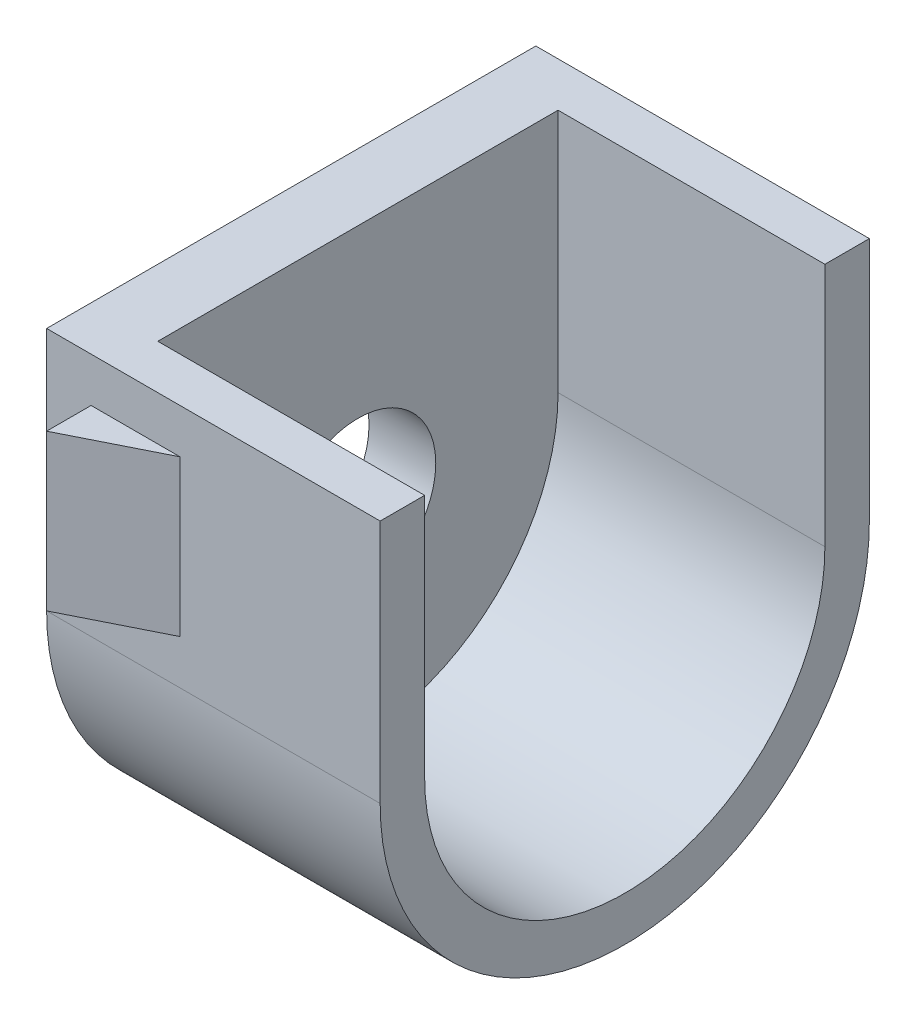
ISO-10303-21;
HEADER;
FILE_DESCRIPTION(('STEP AP214'),'2;1');
FILE_NAME('part.step','',(''),(''),'','','');
FILE_SCHEMA(('AUTOMOTIVE_DESIGN { 1 0 10303 214 1 1 1 1 }'));
ENDSEC;
DATA;
#1=APPLICATION_CONTEXT('core data for automotive mechanical design processes');
#2=APPLICATION_PROTOCOL_DEFINITION('international standard','automotive_design',2000,#1);
#3=PRODUCT_CONTEXT('',#1,'mechanical');
#4=PRODUCT('Part','Part','',(#3));
#5=PRODUCT_RELATED_PRODUCT_CATEGORY('part','',(#4));
#6=PRODUCT_DEFINITION_FORMATION('','',#4);
#7=PRODUCT_DEFINITION_CONTEXT('part definition',#1,'design');
#8=PRODUCT_DEFINITION('design','',#6,#7);
#9=PRODUCT_DEFINITION_SHAPE('','',#8);
#10=(LENGTH_UNIT() NAMED_UNIT(*) SI_UNIT(.MILLI.,.METRE.));
#11=(NAMED_UNIT(*) PLANE_ANGLE_UNIT() SI_UNIT($,.RADIAN.));
#12=(NAMED_UNIT(*) SI_UNIT($,.STERADIAN.) SOLID_ANGLE_UNIT());
#13=UNCERTAINTY_MEASURE_WITH_UNIT(LENGTH_MEASURE(1.E-05),#10,'distance_accuracy_value','');
#14=(GEOMETRIC_REPRESENTATION_CONTEXT(3) GLOBAL_UNCERTAINTY_ASSIGNED_CONTEXT((#13)) GLOBAL_UNIT_ASSIGNED_CONTEXT((#10,
#11,#12)) REPRESENTATION_CONTEXT('',''));
#15=CARTESIAN_POINT('',(0.,0.,0.));
#16=DIRECTION('',(0.,0.,1.));
#17=DIRECTION('',(1.,0.,0.));
#18=AXIS2_PLACEMENT_3D('',#15,#16,#17);
#19=CARTESIAN_POINT('',(15.,0.,11.));
#20=DIRECTION('',(0.,0.,-1.));
#21=DIRECTION('',(-1.,0.,0.));
#22=AXIS2_PLACEMENT_3D('',#19,#20,#21);
#23=PLANE('',#22);
#24=DIRECTION('',(-1.,0.,0.));
#25=VECTOR('',#24,1.);
#26=CARTESIAN_POINT('',(15.,11.,11.));
#27=LINE('',#26,#25);
#28=CARTESIAN_POINT('',(15.,11.,11.));
#29=VERTEX_POINT('',#28);
#30=CARTESIAN_POINT('',(0.,11.,11.));
#31=VERTEX_POINT('',#30);
#32=EDGE_CURVE('E285',#29,#31,#27,.T.);
#33=ORIENTED_EDGE('',*,*,#32,.T.);
#34=DIRECTION('',(0.,-1.,0.));
#35=VECTOR('',#34,1.);
#36=CARTESIAN_POINT('',(0.,0.,11.));
#37=LINE('',#36,#35);
#38=CARTESIAN_POINT('',(0.,0.,11.));
#39=VERTEX_POINT('',#38);
#40=EDGE_CURVE('E258',#31,#39,#37,.T.);
#41=ORIENTED_EDGE('',*,*,#40,.T.);
#42=DIRECTION('',(-1.,0.,0.));
#43=VECTOR('',#42,1.);
#44=CARTESIAN_POINT('',(15.,0.,11.));
#45=LINE('',#44,#43);
#46=CARTESIAN_POINT('',(15.,0.,11.));
#47=VERTEX_POINT('',#46);
#48=EDGE_CURVE('E269',#47,#39,#45,.T.);
#49=ORIENTED_EDGE('',*,*,#48,.F.);
#50=DIRECTION('',(0.,-1.,0.));
#51=VECTOR('',#50,1.);
#52=CARTESIAN_POINT('',(15.,0.,11.));
#53=LINE('',#52,#51);
#54=EDGE_CURVE('E266',#29,#47,#53,.T.);
#55=ORIENTED_EDGE('',*,*,#54,.F.);
#56=EDGE_LOOP('',(#33,#41,#49,#55));
#57=FACE_BOUND('',#56,.T.);
#58=DIRECTION('',(0.,-1.,0.));
#59=VECTOR('',#58,1.);
#60=CARTESIAN_POINT('',(2.,9.,11.));
#61=LINE('',#60,#59);
#62=CARTESIAN_POINT('',(2.,9.,11.));
#63=VERTEX_POINT('',#62);
#64=CARTESIAN_POINT('',(2.,2.,11.));
#65=VERTEX_POINT('',#64);
#66=EDGE_CURVE('E166',#63,#65,#61,.T.);
#67=ORIENTED_EDGE('',*,*,#66,.F.);
#68=DIRECTION('',(-1.,0.,0.));
#69=VECTOR('',#68,1.);
#70=CARTESIAN_POINT('',(2.,9.,11.));
#71=LINE('',#70,#69);
#72=CARTESIAN_POINT('',(6.,9.,11.));
#73=VERTEX_POINT('',#72);
#74=EDGE_CURVE('E157',#73,#63,#71,.T.);
#75=ORIENTED_EDGE('',*,*,#74,.F.);
#76=DIRECTION('',(0.,1.,0.));
#77=VECTOR('',#76,1.);
#78=CARTESIAN_POINT('',(6.,9.,11.));
#79=LINE('',#78,#77);
#80=CARTESIAN_POINT('',(6.,2.,11.));
#81=VERTEX_POINT('',#80);
#82=EDGE_CURVE('E534',#81,#73,#79,.T.);
#83=ORIENTED_EDGE('',*,*,#82,.F.);
#84=DIRECTION('',(1.,0.,0.));
#85=VECTOR('',#84,1.);
#86=CARTESIAN_POINT('',(2.,2.,11.));
#87=LINE('',#86,#85);
#88=EDGE_CURVE('E59',#65,#81,#87,.T.);
#89=ORIENTED_EDGE('',*,*,#88,.F.);
#90=EDGE_LOOP('',(#67,#75,#83,#89));
#91=FACE_BOUND('',#90,.T.);
#92=ADVANCED_FACE('F43',(#57,#91),#23,.F.);
#93=CARTESIAN_POINT('',(15.,0.,-11.));
#94=DIRECTION('',(0.,0.,1.));
#95=DIRECTION('',(1.,0.,0.));
#96=AXIS2_PLACEMENT_3D('',#93,#94,#95);
#97=PLANE('',#96);
#98=DIRECTION('',(-1.,0.,0.));
#99=VECTOR('',#98,1.);
#100=CARTESIAN_POINT('',(15.,0.,-11.));
#101=LINE('',#100,#99);
#102=CARTESIAN_POINT('',(15.,0.,-11.));
#103=VERTEX_POINT('',#102);
#104=CARTESIAN_POINT('',(0.,0.,-11.));
#105=VERTEX_POINT('',#104);
#106=EDGE_CURVE('E11',#103,#105,#101,.T.);
#107=ORIENTED_EDGE('',*,*,#106,.T.);
#108=DIRECTION('',(0.,1.,0.));
#109=VECTOR('',#108,1.);
#110=CARTESIAN_POINT('',(0.,0.,-11.));
#111=LINE('',#110,#109);
#112=CARTESIAN_POINT('',(0.,11.,-11.));
#113=VERTEX_POINT('',#112);
#114=EDGE_CURVE('E273',#105,#113,#111,.T.);
#115=ORIENTED_EDGE('',*,*,#114,.T.);
#116=DIRECTION('',(-1.,0.,0.));
#117=VECTOR('',#116,1.);
#118=CARTESIAN_POINT('',(15.,11.,-11.));
#119=LINE('',#118,#117);
#120=CARTESIAN_POINT('',(15.,11.,-11.));
#121=VERTEX_POINT('',#120);
#122=EDGE_CURVE('E52',#121,#113,#119,.T.);
#123=ORIENTED_EDGE('',*,*,#122,.F.);
#124=DIRECTION('',(0.,1.,0.));
#125=VECTOR('',#124,1.);
#126=CARTESIAN_POINT('',(15.,0.,-11.));
#127=LINE('',#126,#125);
#128=EDGE_CURVE('E257',#103,#121,#127,.T.);
#129=ORIENTED_EDGE('',*,*,#128,.F.);
#130=EDGE_LOOP('',(#107,#115,#123,#129));
#131=FACE_BOUND('',#130,.T.);
#132=DIRECTION('',(0.,-1.,0.));
#133=VECTOR('',#132,1.);
#134=CARTESIAN_POINT('',(6.,9.,-11.));
#135=LINE('',#134,#133);
#136=CARTESIAN_POINT('',(6.,9.,-11.));
#137=VERTEX_POINT('',#136);
#138=CARTESIAN_POINT('',(6.,2.,-11.));
#139=VERTEX_POINT('',#138);
#140=EDGE_CURVE('E180',#137,#139,#135,.T.);
#141=ORIENTED_EDGE('',*,*,#140,.F.);
#142=DIRECTION('',(1.,0.,0.));
#143=VECTOR('',#142,1.);
#144=CARTESIAN_POINT('',(6.,9.,-11.));
#145=LINE('',#144,#143);
#146=CARTESIAN_POINT('',(2.,9.,-11.));
#147=VERTEX_POINT('',#146);
#148=EDGE_CURVE('E185',#147,#137,#145,.T.);
#149=ORIENTED_EDGE('',*,*,#148,.F.);
#150=DIRECTION('',(0.,1.,0.));
#151=VECTOR('',#150,1.);
#152=CARTESIAN_POINT('',(2.,9.,-11.));
#153=LINE('',#152,#151);
#154=CARTESIAN_POINT('',(2.,2.,-11.));
#155=VERTEX_POINT('',#154);
#156=EDGE_CURVE('E67',#155,#147,#153,.T.);
#157=ORIENTED_EDGE('',*,*,#156,.F.);
#158=DIRECTION('',(-1.,0.,0.));
#159=VECTOR('',#158,1.);
#160=CARTESIAN_POINT('',(6.,2.,-11.));
#161=LINE('',#160,#159);
#162=EDGE_CURVE('E188',#139,#155,#161,.T.);
#163=ORIENTED_EDGE('',*,*,#162,.F.);
#164=EDGE_LOOP('',(#141,#149,#157,#163));
#165=FACE_BOUND('',#164,.T.);
#166=ADVANCED_FACE('F334',(#131,#165),#97,.F.);
#167=CARTESIAN_POINT('',(15.,11.,11.));
#168=DIRECTION('',(0.,-1.,0.));
#169=DIRECTION('',(0.,0.,-1.));
#170=AXIS2_PLACEMENT_3D('',#167,#168,#169);
#171=PLANE('',#170);
#172=DIRECTION('',(1.,0.,0.));
#173=VECTOR('',#172,1.);
#174=CARTESIAN_POINT('',(3.,11.,9.));
#175=LINE('',#174,#173);
#176=CARTESIAN_POINT('',(3.,11.,9.));
#177=VERTEX_POINT('',#176);
#178=CARTESIAN_POINT('',(15.,11.,9.));
#179=VERTEX_POINT('',#178);
#180=EDGE_CURVE('E249',#177,#179,#175,.T.);
#181=ORIENTED_EDGE('',*,*,#180,.F.);
#182=DIRECTION('',(0.,0.,-1.));
#183=VECTOR('',#182,1.);
#184=CARTESIAN_POINT('',(3.,11.,9.));
#185=LINE('',#184,#183);
#186=CARTESIAN_POINT('',(3.,11.,-9.));
#187=VERTEX_POINT('',#186);
#188=EDGE_CURVE('E216',#177,#187,#185,.T.);
#189=ORIENTED_EDGE('',*,*,#188,.T.);
#190=DIRECTION('',(1.,0.,0.));
#191=VECTOR('',#190,1.);
#192=CARTESIAN_POINT('',(3.,11.,-9.));
#193=LINE('',#192,#191);
#194=CARTESIAN_POINT('',(15.,11.,-9.));
#195=VERTEX_POINT('',#194);
#196=EDGE_CURVE('E245',#187,#195,#193,.T.);
#197=ORIENTED_EDGE('',*,*,#196,.T.);
#198=DIRECTION('',(0.,0.,1.));
#199=VECTOR('',#198,1.);
#200=CARTESIAN_POINT('',(15.,11.,11.));
#201=LINE('',#200,#199);
#202=EDGE_CURVE('E262',#121,#195,#201,.T.);
#203=ORIENTED_EDGE('',*,*,#202,.F.);
#204=ORIENTED_EDGE('',*,*,#122,.T.);
#205=DIRECTION('',(0.,0.,1.));
#206=VECTOR('',#205,1.);
#207=CARTESIAN_POINT('',(0.,11.,11.));
#208=LINE('',#207,#206);
#209=EDGE_CURVE('E276',#113,#31,#208,.T.);
#210=ORIENTED_EDGE('',*,*,#209,.T.);
#211=ORIENTED_EDGE('',*,*,#32,.F.);
#212=EDGE_CURVE('E261',#179,#29,#201,.T.);
#213=ORIENTED_EDGE('',*,*,#212,.F.);
#214=EDGE_LOOP('',(#181,#189,#197,#203,#204,#210,#211,#213));
#215=FACE_BOUND('',#214,.T.);
#216=ADVANCED_FACE('F294',(#215),#171,.F.);
#217=CARTESIAN_POINT('',(15.,0.,0.));
#218=DIRECTION('',(1.,0.,0.));
#219=DIRECTION('',(0.,0.,-1.));
#220=AXIS2_PLACEMENT_3D('',#217,#218,#219);
#221=PLANE('',#220);
#222=CARTESIAN_POINT('',(15.,0.,0.));
#223=DIRECTION('',(1.,0.,0.));
#224=DIRECTION('',(0.,0.,-1.));
#225=AXIS2_PLACEMENT_3D('',#222,#223,#224);
#226=CIRCLE('',#225,9.);
#227=CARTESIAN_POINT('',(15.,0.,9.));
#228=VERTEX_POINT('',#227);
#229=CARTESIAN_POINT('',(15.,0.,-9.));
#230=VERTEX_POINT('',#229);
#231=EDGE_CURVE('E217',#228,#230,#226,.T.);
#232=ORIENTED_EDGE('',*,*,#231,.F.);
#233=DIRECTION('',(0.,1.,0.));
#234=VECTOR('',#233,1.);
#235=CARTESIAN_POINT('',(15.,0.,9.));
#236=LINE('',#235,#234);
#237=EDGE_CURVE('E208',#228,#179,#236,.T.);
#238=ORIENTED_EDGE('',*,*,#237,.T.);
#239=ORIENTED_EDGE('',*,*,#212,.T.);
#240=ORIENTED_EDGE('',*,*,#54,.T.);
#241=CARTESIAN_POINT('',(15.,0.,0.));
#242=DIRECTION('',(1.,0.,0.));
#243=DIRECTION('',(0.,0.,-1.));
#244=AXIS2_PLACEMENT_3D('',#241,#242,#243);
#245=CIRCLE('',#244,11.);
#246=EDGE_CURVE('E253',#47,#103,#245,.T.);
#247=ORIENTED_EDGE('',*,*,#246,.T.);
#248=ORIENTED_EDGE('',*,*,#128,.T.);
#249=ORIENTED_EDGE('',*,*,#202,.T.);
#250=DIRECTION('',(0.,1.,0.));
#251=VECTOR('',#250,1.);
#252=CARTESIAN_POINT('',(15.,0.,-9.));
#253=LINE('',#252,#251);
#254=EDGE_CURVE('E233',#230,#195,#253,.T.);
#255=ORIENTED_EDGE('',*,*,#254,.F.);
#256=EDGE_LOOP('',(#232,#238,#239,#240,#247,#248,#249,#255));
#257=FACE_BOUND('',#256,.T.);
#258=ADVANCED_FACE('F310',(#257),#221,.T.);
#259=CARTESIAN_POINT('',(15.,0.,0.));
#260=DIRECTION('',(-1.,0.,0.));
#261=DIRECTION('',(0.,0.,1.));
#262=AXIS2_PLACEMENT_3D('',#259,#260,#261);
#263=CYLINDRICAL_SURFACE('',#262,11.);
#264=CARTESIAN_POINT('',(0.,0.,0.));
#265=DIRECTION('',(1.,0.,0.));
#266=DIRECTION('',(0.,0.,-1.));
#267=AXIS2_PLACEMENT_3D('',#264,#265,#266);
#268=CIRCLE('',#267,11.);
#269=EDGE_CURVE('E252',#39,#105,#268,.T.);
#270=ORIENTED_EDGE('',*,*,#269,.T.);
#271=ORIENTED_EDGE('',*,*,#106,.F.);
#272=ORIENTED_EDGE('',*,*,#246,.F.);
#273=ORIENTED_EDGE('',*,*,#48,.T.);
#274=EDGE_LOOP('',(#270,#271,#272,#273));
#275=FACE_BOUND('',#274,.T.);
#276=ADVANCED_FACE('F45',(#275),#263,.T.);
#277=CARTESIAN_POINT('',(0.,0.,0.));
#278=DIRECTION('',(1.,0.,0.));
#279=DIRECTION('',(0.,0.,-1.));
#280=AXIS2_PLACEMENT_3D('',#277,#278,#279);
#281=PLANE('',#280);
#282=CARTESIAN_POINT('',(0.,0.,0.));
#283=DIRECTION('',(1.,0.,0.));
#284=DIRECTION('',(0.,0.,-1.));
#285=AXIS2_PLACEMENT_3D('',#282,#283,#284);
#286=CIRCLE('',#285,3.5);
#287=CARTESIAN_POINT('',(0.,0.,-3.5));
#288=VERTEX_POINT('',#287);
#289=EDGE_CURVE('E204',#288,#288,#286,.T.);
#290=ORIENTED_EDGE('',*,*,#289,.T.);
#291=EDGE_LOOP('',(#290));
#292=FACE_BOUND('',#291,.T.);
#293=ORIENTED_EDGE('',*,*,#269,.F.);
#294=ORIENTED_EDGE('',*,*,#40,.F.);
#295=ORIENTED_EDGE('',*,*,#209,.F.);
#296=ORIENTED_EDGE('',*,*,#114,.F.);
#297=EDGE_LOOP('',(#293,#294,#295,#296));
#298=FACE_BOUND('',#297,.T.);
#299=ADVANCED_FACE('F301',(#292,#298),#281,.F.);
#300=CARTESIAN_POINT('',(3.,0.,9.));
#301=DIRECTION('',(0.,0.,-1.));
#302=DIRECTION('',(-1.,0.,0.));
#303=AXIS2_PLACEMENT_3D('',#300,#301,#302);
#304=PLANE('',#303);
#305=ORIENTED_EDGE('',*,*,#237,.F.);
#306=DIRECTION('',(1.,0.,0.));
#307=VECTOR('',#306,1.);
#308=CARTESIAN_POINT('',(3.,0.,9.));
#309=LINE('',#308,#307);
#310=CARTESIAN_POINT('',(3.,0.,9.));
#311=VERTEX_POINT('',#310);
#312=EDGE_CURVE('E229',#311,#228,#309,.T.);
#313=ORIENTED_EDGE('',*,*,#312,.F.);
#314=DIRECTION('',(0.,1.,0.));
#315=VECTOR('',#314,1.);
#316=CARTESIAN_POINT('',(3.,0.,9.));
#317=LINE('',#316,#315);
#318=EDGE_CURVE('E212',#311,#177,#317,.T.);
#319=ORIENTED_EDGE('',*,*,#318,.T.);
#320=ORIENTED_EDGE('',*,*,#180,.T.);
#321=EDGE_LOOP('',(#305,#313,#319,#320));
#322=FACE_BOUND('',#321,.T.);
#323=ADVANCED_FACE('F314',(#322),#304,.T.);
#324=CARTESIAN_POINT('',(3.,0.,-9.));
#325=DIRECTION('',(0.,0.,-1.));
#326=DIRECTION('',(-1.,0.,0.));
#327=AXIS2_PLACEMENT_3D('',#324,#325,#326);
#328=PLANE('',#327);
#329=ORIENTED_EDGE('',*,*,#254,.T.);
#330=ORIENTED_EDGE('',*,*,#196,.F.);
#331=DIRECTION('',(0.,1.,0.));
#332=VECTOR('',#331,1.);
#333=CARTESIAN_POINT('',(3.,0.,-9.));
#334=LINE('',#333,#332);
#335=CARTESIAN_POINT('',(3.,0.,-9.));
#336=VERTEX_POINT('',#335);
#337=EDGE_CURVE('E221',#336,#187,#334,.T.);
#338=ORIENTED_EDGE('',*,*,#337,.F.);
#339=DIRECTION('',(1.,0.,0.));
#340=VECTOR('',#339,1.);
#341=CARTESIAN_POINT('',(3.,0.,-9.));
#342=LINE('',#341,#340);
#343=EDGE_CURVE('E242',#336,#230,#342,.T.);
#344=ORIENTED_EDGE('',*,*,#343,.T.);
#345=EDGE_LOOP('',(#329,#330,#338,#344));
#346=FACE_BOUND('',#345,.T.);
#347=ADVANCED_FACE('F324',(#346),#328,.F.);
#348=CARTESIAN_POINT('',(3.,0.,0.));
#349=DIRECTION('',(1.,0.,0.));
#350=DIRECTION('',(0.,0.,-1.));
#351=AXIS2_PLACEMENT_3D('',#348,#349,#350);
#352=CYLINDRICAL_SURFACE('',#351,9.);
#353=ORIENTED_EDGE('',*,*,#231,.T.);
#354=ORIENTED_EDGE('',*,*,#343,.F.);
#355=CARTESIAN_POINT('',(3.,0.,0.));
#356=DIRECTION('',(1.,0.,0.));
#357=DIRECTION('',(0.,0.,-1.));
#358=AXIS2_PLACEMENT_3D('',#355,#356,#357);
#359=CIRCLE('',#358,9.);
#360=EDGE_CURVE('E225',#311,#336,#359,.T.);
#361=ORIENTED_EDGE('',*,*,#360,.F.);
#362=ORIENTED_EDGE('',*,*,#312,.T.);
#363=EDGE_LOOP('',(#353,#354,#361,#362));
#364=FACE_BOUND('',#363,.T.);
#365=ADVANCED_FACE('F320',(#364),#352,.F.);
#366=CARTESIAN_POINT('',(3.,0.,0.));
#367=DIRECTION('',(1.,0.,0.));
#368=DIRECTION('',(0.,0.,-1.));
#369=AXIS2_PLACEMENT_3D('',#366,#367,#368);
#370=PLANE('',#369);
#371=CARTESIAN_POINT('',(3.,0.,0.));
#372=DIRECTION('',(1.,0.,0.));
#373=DIRECTION('',(0.,0.,-1.));
#374=AXIS2_PLACEMENT_3D('',#371,#372,#373);
#375=CIRCLE('',#374,3.5);
#376=CARTESIAN_POINT('',(3.,0.,-3.5));
#377=VERTEX_POINT('',#376);
#378=EDGE_CURVE('E203',#377,#377,#375,.T.);
#379=ORIENTED_EDGE('',*,*,#378,.F.);
#380=EDGE_LOOP('',(#379));
#381=FACE_BOUND('',#380,.T.);
#382=ORIENTED_EDGE('',*,*,#318,.F.);
#383=ORIENTED_EDGE('',*,*,#360,.T.);
#384=ORIENTED_EDGE('',*,*,#337,.T.);
#385=ORIENTED_EDGE('',*,*,#188,.F.);
#386=EDGE_LOOP('',(#382,#383,#384,#385));
#387=FACE_BOUND('',#386,.T.);
#388=ADVANCED_FACE('F318',(#381,#387),#370,.T.);
#389=CARTESIAN_POINT('',(0.,0.,0.));
#390=DIRECTION('',(1.,0.,0.));
#391=DIRECTION('',(0.,0.,-1.));
#392=AXIS2_PLACEMENT_3D('',#389,#390,#391);
#393=CYLINDRICAL_SURFACE('',#392,3.5);
#394=ORIENTED_EDGE('',*,*,#289,.F.);
#395=EDGE_LOOP('',(#394));
#396=FACE_BOUND('',#395,.T.);
#397=ORIENTED_EDGE('',*,*,#378,.T.);
#398=EDGE_LOOP('',(#397));
#399=FACE_BOUND('',#398,.T.);
#400=ADVANCED_FACE('F357',(#396,#399),#393,.F.);
#401=CARTESIAN_POINT('',(6.,2.,-13.));
#402=DIRECTION('',(0.,1.,0.));
#403=DIRECTION('',(0.,0.,1.));
#404=AXIS2_PLACEMENT_3D('',#401,#402,#403);
#405=PLANE('',#404);
#406=DIRECTION('',(0.,0.,1.));
#407=VECTOR('',#406,1.);
#408=CARTESIAN_POINT('',(2.,2.,-13.));
#409=LINE('',#408,#407);
#410=CARTESIAN_POINT('',(2.,2.,-13.));
#411=VERTEX_POINT('',#410);
#412=EDGE_CURVE('E199',#411,#155,#409,.T.);
#413=ORIENTED_EDGE('',*,*,#412,.F.);
#414=DIRECTION('',(0.894427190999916,0.,0.447213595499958));
#415=VECTOR('',#414,1.);
#416=CARTESIAN_POINT('',(5.2,2.,-11.4));
#417=LINE('',#416,#415);
#418=EDGE_CURVE('E172',#411,#139,#417,.T.);
#419=ORIENTED_EDGE('',*,*,#418,.T.);
#420=ORIENTED_EDGE('',*,*,#162,.T.);
#421=EDGE_LOOP('',(#413,#419,#420));
#422=FACE_BOUND('',#421,.T.);
#423=ADVANCED_FACE('F360',(#422),#405,.F.);
#424=CARTESIAN_POINT('',(2.,9.,-13.));
#425=DIRECTION('',(1.,0.,0.));
#426=DIRECTION('',(0.,1.,0.));
#427=AXIS2_PLACEMENT_3D('',#424,#425,#426);
#428=PLANE('',#427);
#429=ORIENTED_EDGE('',*,*,#156,.T.);
#430=DIRECTION('',(0.,0.,1.));
#431=VECTOR('',#430,1.);
#432=CARTESIAN_POINT('',(2.,9.,-13.));
#433=LINE('',#432,#431);
#434=CARTESIAN_POINT('',(2.,9.,-13.));
#435=VERTEX_POINT('',#434);
#436=EDGE_CURVE('E184',#435,#147,#433,.T.);
#437=ORIENTED_EDGE('',*,*,#436,.F.);
#438=DIRECTION('',(0.,1.,0.));
#439=VECTOR('',#438,1.);
#440=CARTESIAN_POINT('',(2.,9.,-13.));
#441=LINE('',#440,#439);
#442=EDGE_CURVE('E181',#411,#435,#441,.T.);
#443=ORIENTED_EDGE('',*,*,#442,.F.);
#444=ORIENTED_EDGE('',*,*,#412,.T.);
#445=EDGE_LOOP('',(#429,#437,#443,#444));
#446=FACE_BOUND('',#445,.T.);
#447=ADVANCED_FACE('F371',(#446),#428,.F.);
#448=CARTESIAN_POINT('',(6.,9.,-13.));
#449=DIRECTION('',(0.,-1.,0.));
#450=DIRECTION('',(0.,0.,-1.));
#451=AXIS2_PLACEMENT_3D('',#448,#449,#450);
#452=PLANE('',#451);
#453=ORIENTED_EDGE('',*,*,#148,.T.);
#454=DIRECTION('',(0.894427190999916,0.,0.447213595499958));
#455=VECTOR('',#454,1.);
#456=CARTESIAN_POINT('',(2.,9.,-13.));
#457=LINE('',#456,#455);
#458=EDGE_CURVE('E168',#435,#137,#457,.T.);
#459=ORIENTED_EDGE('',*,*,#458,.F.);
#460=ORIENTED_EDGE('',*,*,#436,.T.);
#461=EDGE_LOOP('',(#453,#459,#460));
#462=FACE_BOUND('',#461,.T.);
#463=ADVANCED_FACE('F375',(#462),#452,.F.);
#464=CARTESIAN_POINT('',(2.,-11.,-13.));
#465=DIRECTION('',(-0.447213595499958,0.,0.894427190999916));
#466=DIRECTION('',(0.894427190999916,0.,0.447213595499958));
#467=AXIS2_PLACEMENT_3D('',#464,#465,#466);
#468=PLANE('',#467);
#469=ORIENTED_EDGE('',*,*,#442,.T.);
#470=ORIENTED_EDGE('',*,*,#458,.T.);
#471=ORIENTED_EDGE('',*,*,#140,.T.);
#472=ORIENTED_EDGE('',*,*,#418,.F.);
#473=EDGE_LOOP('',(#469,#470,#471,#472));
#474=FACE_BOUND('',#473,.T.);
#475=ADVANCED_FACE('F379',(#474),#468,.F.);
#476=CARTESIAN_POINT('',(2.,9.,13.));
#477=DIRECTION('',(1.,0.,0.));
#478=DIRECTION('',(0.,1.,0.));
#479=AXIS2_PLACEMENT_3D('',#476,#477,#478);
#480=PLANE('',#479);
#481=ORIENTED_EDGE('',*,*,#66,.T.);
#482=DIRECTION('',(0.,0.,-1.));
#483=VECTOR('',#482,1.);
#484=CARTESIAN_POINT('',(2.,2.,13.));
#485=LINE('',#484,#483);
#486=CARTESIAN_POINT('',(2.,2.,13.));
#487=VERTEX_POINT('',#486);
#488=EDGE_CURVE('E161',#487,#65,#485,.T.);
#489=ORIENTED_EDGE('',*,*,#488,.F.);
#490=DIRECTION('',(0.,-1.,0.));
#491=VECTOR('',#490,1.);
#492=CARTESIAN_POINT('',(2.,9.,13.));
#493=LINE('',#492,#491);
#494=CARTESIAN_POINT('',(2.,9.,13.));
#495=VERTEX_POINT('',#494);
#496=EDGE_CURVE('E145',#495,#487,#493,.T.);
#497=ORIENTED_EDGE('',*,*,#496,.F.);
#498=DIRECTION('',(0.,0.,-1.));
#499=VECTOR('',#498,1.);
#500=CARTESIAN_POINT('',(2.,9.,13.));
#501=LINE('',#500,#499);
#502=EDGE_CURVE('E156',#495,#63,#501,.T.);
#503=ORIENTED_EDGE('',*,*,#502,.T.);
#504=EDGE_LOOP('',(#481,#489,#497,#503));
#505=FACE_BOUND('',#504,.T.);
#506=ADVANCED_FACE('F165',(#505),#480,.F.);
#507=CARTESIAN_POINT('',(2.,2.,13.));
#508=DIRECTION('',(0.,1.,0.));
#509=DIRECTION('',(0.,0.,1.));
#510=AXIS2_PLACEMENT_3D('',#507,#508,#509);
#511=PLANE('',#510);
#512=ORIENTED_EDGE('',*,*,#88,.T.);
#513=DIRECTION('',(0.894427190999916,0.,-0.447213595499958));
#514=VECTOR('',#513,1.);
#515=CARTESIAN_POINT('',(2.,2.,13.));
#516=LINE('',#515,#514);
#517=EDGE_CURVE('E148',#487,#81,#516,.T.);
#518=ORIENTED_EDGE('',*,*,#517,.F.);
#519=ORIENTED_EDGE('',*,*,#488,.T.);
#520=EDGE_LOOP('',(#512,#518,#519));
#521=FACE_BOUND('',#520,.T.);
#522=ADVANCED_FACE('F160',(#521),#511,.F.);
#523=CARTESIAN_POINT('',(2.,9.,13.));
#524=DIRECTION('',(0.,-1.,0.));
#525=DIRECTION('',(0.,0.,-1.));
#526=AXIS2_PLACEMENT_3D('',#523,#524,#525);
#527=PLANE('',#526);
#528=ORIENTED_EDGE('',*,*,#502,.F.);
#529=DIRECTION('',(0.894427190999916,0.,-0.447213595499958));
#530=VECTOR('',#529,1.);
#531=CARTESIAN_POINT('',(2.,9.,13.));
#532=LINE('',#531,#530);
#533=EDGE_CURVE('E150',#495,#73,#532,.T.);
#534=ORIENTED_EDGE('',*,*,#533,.T.);
#535=ORIENTED_EDGE('',*,*,#74,.T.);
#536=EDGE_LOOP('',(#528,#534,#535));
#537=FACE_BOUND('',#536,.T.);
#538=ADVANCED_FACE('F388',(#537),#527,.F.);
#539=CARTESIAN_POINT('',(2.,11.,13.));
#540=DIRECTION('',(-0.447213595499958,0.,-0.894427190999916));
#541=DIRECTION('',(-0.894427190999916,0.,0.447213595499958));
#542=AXIS2_PLACEMENT_3D('',#539,#540,#541);
#543=PLANE('',#542);
#544=ORIENTED_EDGE('',*,*,#496,.T.);
#545=ORIENTED_EDGE('',*,*,#517,.T.);
#546=ORIENTED_EDGE('',*,*,#82,.T.);
#547=ORIENTED_EDGE('',*,*,#533,.F.);
#548=EDGE_LOOP('',(#544,#545,#546,#547));
#549=FACE_BOUND('',#548,.T.);
#550=ADVANCED_FACE('F147',(#549),#543,.F.);
#551=CLOSED_SHELL('',(#92,#166,#216,#258,#276,#299,#323,#347,#365,#388,#400,#423,#447,#463,#475,
#506,#522,#538,#550));
#552=MANIFOLD_SOLID_BREP('B2',#551);
#553=ADVANCED_BREP_SHAPE_REPRESENTATION('',(#18,#552),#14);
#554=SHAPE_DEFINITION_REPRESENTATION(#9,#553);
ENDSEC;
END-ISO-10303-21;
